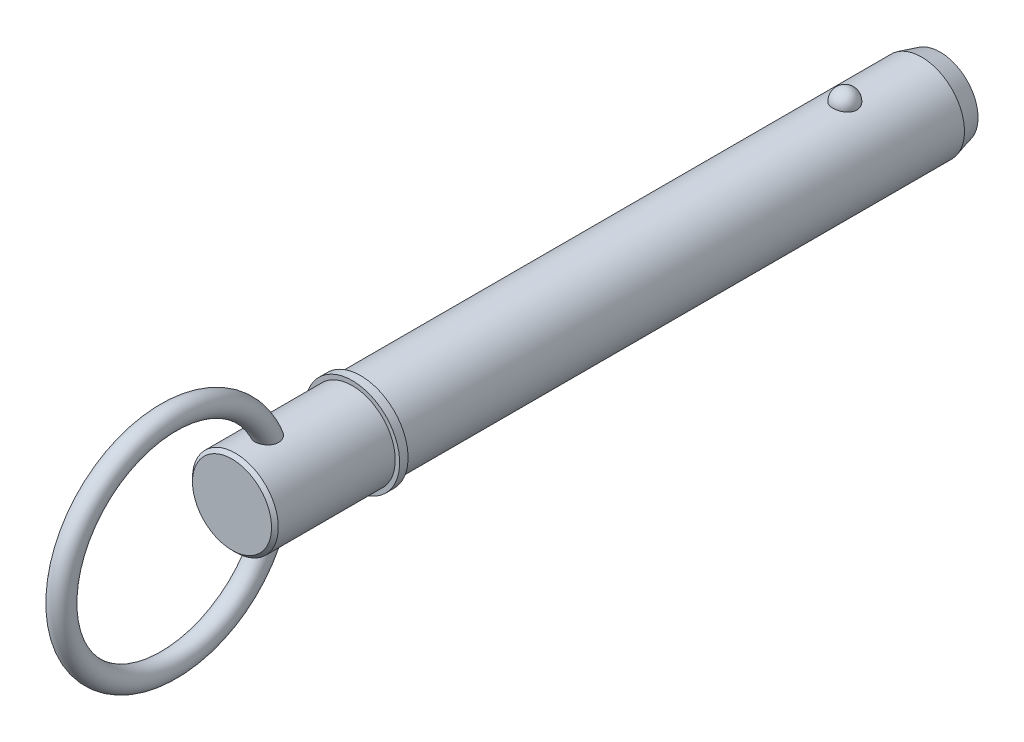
from build123d import *

# Parameters (mm, degrees)
SKETCH2_R           = 12.7
BOSS_EXTRUDE1_DEPTH = 139.7
BOSS_EXTRUDE2_START = 31.75
SKETCH3_R           = 12.7
BOSS_EXTRUDE2_DEPTH = 31.75
CHAMFER1_SIZE       = 5.5
CHAMFER1_SIZE2      = 1.473720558
SKETCH20_W          = 2.5
SKETCH20_H          = 14
SKETCH21_R          = 12.7
BOSS_EXTRUDE3_DEPTH = 38.1
CHAMFER2_SIZE       = 1
SKETCH24_R          = 3.25


with BuildPart() as part:
    # Sketch2 → Boss-Extrude1 (new body)
    with BuildSketch(Plane.XY):
        Circle(SKETCH2_R)
    extrude(amount=BOSS_EXTRUDE1_DEPTH)

    # Sketch3 → Boss-Extrude2 (add)
    with BuildSketch(Plane(origin=(0, 0, 0), x_dir=(-1, 0, 0), z_dir=(0, 0, -1)).offset(BOSS_EXTRUDE2_START)):
        Circle(SKETCH3_R)
    extrude(amount=-BOSS_EXTRUDE2_DEPTH)

    # Chamfer1
    chamfer1_edges = [part.edges().sort_by_distance(p)[0] for p in [
        (12.7, 0, -31.75),
    ]]
    chamfer1_side = [part.faces().sort_by_distance(p)[0] for p in [
        (12.7, 0, -15.875),
    ]]
    chamfer(chamfer1_edges, length=CHAMFER1_SIZE, length2=CHAMFER1_SIZE2, reference=chamfer1_side[0])

    # Sketch18 → Revolve1 (revolve)
    with BuildSketch(Plane(origin=(0, 0, 0), x_dir=(0, 0, -1), z_dir=(1, 0, 0))):
        with BuildLine():
            Line((3.56, 16.26), (3.56, 9.14))
            ThreePointArc((3.56, 9.14), (0, 12.7), (3.56, 16.26))
        make_face()
    revolve(axis=Axis((0, 16.26, -3.56), (0, -1, 0)))

    # Sketch20 → Revolve2 (revolve)
    with BuildSketch(Plane(origin=(0, 0, 0), x_dir=(0, 0, -1), z_dir=(1, 0, 0)), mode=Mode.PRIVATE) as revolve2_sk:
        with Locations((-140.95, 7)):
            Rectangle(SKETCH20_W, SKETCH20_H)
    revolve(revolve2_sk.sketch.rotate(Axis((0, 0, 33.728787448), (0, 0, 1)), 90), axis=Axis((0, 0, 33.728787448), (0, 0, 1)))

    # Sketch21 → Boss-Extrude3 (add)
    with BuildSketch(Plane(origin=(0, 0, 139.7), x_dir=(-1, 0, 0), z_dir=(0, 0, -1))):
        Circle(SKETCH21_R)
    extrude(amount=-BOSS_EXTRUDE3_DEPTH)

    # Chamfer2
    chamfer2_edges = [part.edges().sort_by_distance(p)[0] for p in [
        (12.7, 0, 177.8),
    ]]
    chamfer(chamfer2_edges, length=CHAMFER2_SIZE)

    # Sweep1: sweep along a path in Sketch23
    with BuildLine(Plane(origin=(0, 0, 0), x_dir=(0, 0, -1), z_dir=(1, 0, 0))) as sweep1_path:
        CenterArc((-196.55, 0), 31.75, 0, 360)
    # Sketch24 → Sweep1 (sweep)
    with BuildSketch(Plane(origin=(0, 0, 0), x_dir=(1, 0, 0), z_dir=(0, 1, 0))):
        with Locations((0, -164.8)):
            Circle(SKETCH24_R)
    sweep(path=sweep1_path.line)


solid = part.part
